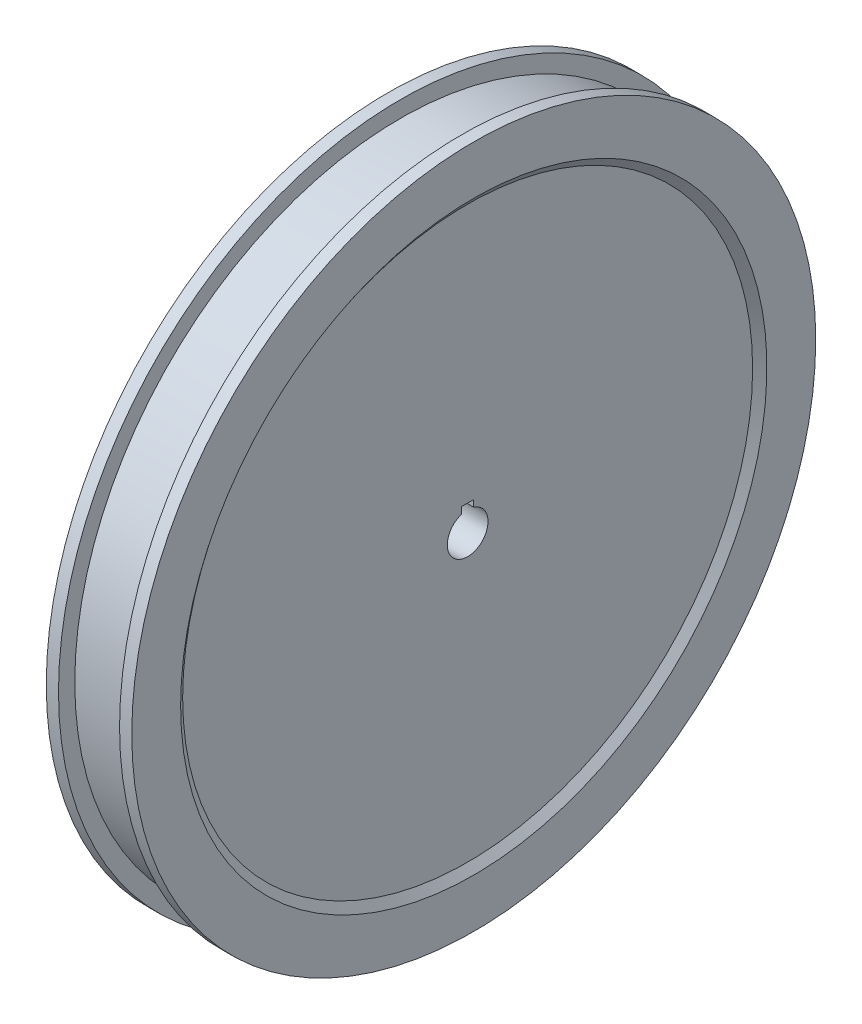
from build123d import *

# Parameters (mm, degrees)
ESQUISSE3_W             = 3
ESQUISSE3_H             = 6.4
ENL_V_MAT_EXTRU_1_DEPTH = 121.383761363


with BuildPart() as part:
    # Esquisse1 → R_volution1 (revolve)
    with BuildSketch(Plane.XY, mode=Mode.PRIVATE) as r_volution1_sk:
        Polygon((-9, 70), (-9, 5), (9, 5), (9, 70), (10.5, 72), (10.5, 84), (7.5, 84), (7.5, 80), (-7.5, 80), (-7.5, 84), (-10.5, 84), (-10.5, 72), align=None)
    revolve(r_volution1_sk.sketch.rotate(Axis((0, 0, 0), (1, 0, 0)), 90), axis=Axis((0, 0, 0), (1, 0, 0)))

    # Esquisse3 → Enl_v. mat.-Extru.1 (cut, through all)
    with BuildSketch(Plane.ZY.offset(9)):
        with Locations((0, 3.2)):
            Rectangle(ESQUISSE3_W, ESQUISSE3_H)
    extrude(amount=-ENL_V_MAT_EXTRU_1_DEPTH, mode=Mode.SUBTRACT)


solid = part.part
